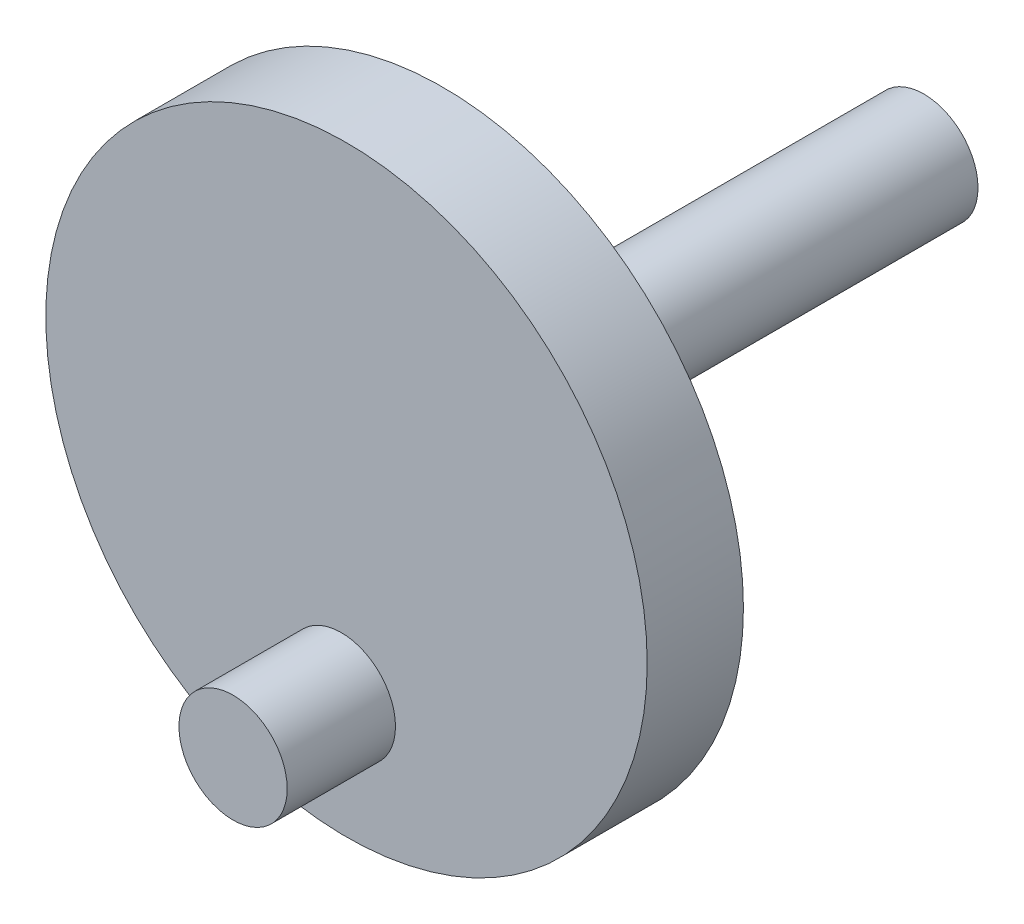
from build123d import *

# Parameters (mm, degrees)
ESQUISSE1_R        = 25
BOSS_EXTRU_1_DEPTH = 8
ESQUISSE2_R        = 4.5
BOSS_EXTRU_2_DEPTH = 9
ESQUISSE4_R        = 4.5
BOSS_EXTRU_3_DEPTH = 40


with BuildPart() as part:
    # Esquisse1 → Boss.-Extru.1 (new body)
    with BuildSketch(Plane.XY):
        Circle(ESQUISSE1_R)
    extrude(amount=BOSS_EXTRU_1_DEPTH)

    # Esquisse2 → Boss.-Extru.2 (add)
    with BuildSketch(Plane.XY.offset(8)):
        with Locations((-0.429213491, -14.993857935)):
            Circle(ESQUISSE2_R)
    extrude(amount=BOSS_EXTRU_2_DEPTH)

    # Esquisse4 → Boss.-Extru.3 (add)
    with BuildSketch(Plane(origin=(0, 0, 0), x_dir=(-1, 0, 0), z_dir=(0, 0, -1))):
        with Locations(Location((0, 0, 0), (0, 0, 180))):
            Circle(ESQUISSE4_R)
    extrude(amount=BOSS_EXTRU_3_DEPTH)


solid = part.part
